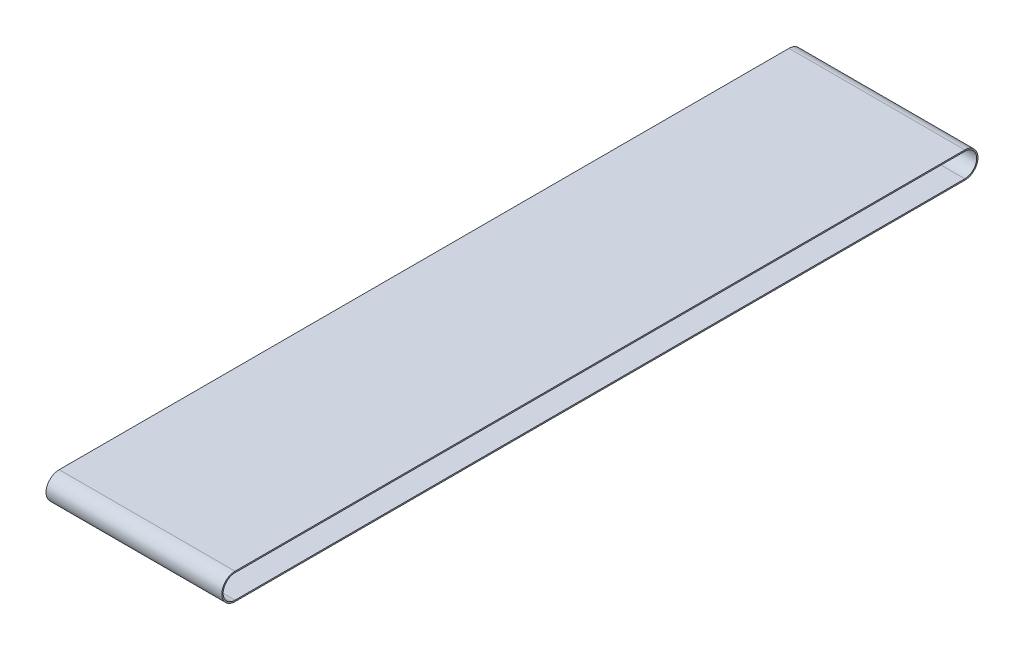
ISO-10303-21;
HEADER;
FILE_DESCRIPTION(('STEP AP214'),'2;1');
FILE_NAME('part.step','',(''),(''),'','','');
FILE_SCHEMA(('AUTOMOTIVE_DESIGN { 1 0 10303 214 1 1 1 1 }'));
ENDSEC;
DATA;
#1=APPLICATION_CONTEXT('core data for automotive mechanical design processes');
#2=APPLICATION_PROTOCOL_DEFINITION('international standard','automotive_design',2000,#1);
#3=PRODUCT_CONTEXT('',#1,'mechanical');
#4=PRODUCT('Part','Part','',(#3));
#5=PRODUCT_RELATED_PRODUCT_CATEGORY('part','',(#4));
#6=PRODUCT_DEFINITION_FORMATION('','',#4);
#7=PRODUCT_DEFINITION_CONTEXT('part definition',#1,'design');
#8=PRODUCT_DEFINITION('design','',#6,#7);
#9=PRODUCT_DEFINITION_SHAPE('','',#8);
#10=(LENGTH_UNIT() NAMED_UNIT(*) SI_UNIT(.MILLI.,.METRE.));
#11=(NAMED_UNIT(*) PLANE_ANGLE_UNIT() SI_UNIT($,.RADIAN.));
#12=(NAMED_UNIT(*) SI_UNIT($,.STERADIAN.) SOLID_ANGLE_UNIT());
#13=UNCERTAINTY_MEASURE_WITH_UNIT(LENGTH_MEASURE(1.E-05),#10,'distance_accuracy_value','');
#14=(GEOMETRIC_REPRESENTATION_CONTEXT(3) GLOBAL_UNCERTAINTY_ASSIGNED_CONTEXT((#13)) GLOBAL_UNIT_ASSIGNED_CONTEXT((#10,
#11,#12)) REPRESENTATION_CONTEXT('',''));
#15=CARTESIAN_POINT('',(0.,0.,0.));
#16=DIRECTION('',(0.,0.,1.));
#17=DIRECTION('',(1.,0.,0.));
#18=AXIS2_PLACEMENT_3D('',#15,#16,#17);
#19=CARTESIAN_POINT('',(400.,30.,0.));
#20=DIRECTION('',(0.,-1.,0.));
#21=DIRECTION('',(0.,0.,-1.));
#22=AXIS2_PLACEMENT_3D('',#19,#20,#21);
#23=PLANE('',#22);
#24=DIRECTION('',(-1.,0.,0.));
#25=VECTOR('',#24,1.);
#26=CARTESIAN_POINT('',(400.,30.,0.));
#27=LINE('',#26,#25);
#28=CARTESIAN_POINT('',(400.,30.,0.));
#29=VERTEX_POINT('',#28);
#30=CARTESIAN_POINT('',(0.,30.,0.));
#31=VERTEX_POINT('',#30);
#32=EDGE_CURVE('E116',#29,#31,#27,.T.);
#33=ORIENTED_EDGE('',*,*,#32,.F.);
#34=DIRECTION('',(0.,0.,-1.));
#35=VECTOR('',#34,1.);
#36=CARTESIAN_POINT('',(400.,30.,0.));
#37=LINE('',#36,#35);
#38=CARTESIAN_POINT('',(400.,30.,-1660.));
#39=VERTEX_POINT('',#38);
#40=EDGE_CURVE('E74',#39,#29,#37,.F.);
#41=ORIENTED_EDGE('',*,*,#40,.F.);
#42=DIRECTION('',(-1.,0.,0.));
#43=VECTOR('',#42,1.);
#44=CARTESIAN_POINT('',(400.,30.,-1660.));
#45=LINE('',#44,#43);
#46=CARTESIAN_POINT('',(0.,30.,-1660.));
#47=VERTEX_POINT('',#46);
#48=EDGE_CURVE('E118',#47,#39,#45,.F.);
#49=ORIENTED_EDGE('',*,*,#48,.F.);
#50=DIRECTION('',(0.,0.,-1.));
#51=VECTOR('',#50,1.);
#52=CARTESIAN_POINT('',(0.,30.,0.));
#53=LINE('',#52,#51);
#54=EDGE_CURVE('E126',#47,#31,#53,.F.);
#55=ORIENTED_EDGE('',*,*,#54,.T.);
#56=EDGE_LOOP('',(#33,#41,#49,#55));
#57=FACE_BOUND('',#56,.T.);
#58=ADVANCED_FACE('F17',(#57),#23,.F.);
#59=CARTESIAN_POINT('',(400.,27.,0.));
#60=DIRECTION('',(0.,-1.,0.));
#61=DIRECTION('',(0.,0.,-1.));
#62=AXIS2_PLACEMENT_3D('',#59,#60,#61);
#63=PLANE('',#62);
#64=DIRECTION('',(0.,0.,-1.));
#65=VECTOR('',#64,1.);
#66=CARTESIAN_POINT('',(400.,27.,0.));
#67=LINE('',#66,#65);
#68=CARTESIAN_POINT('',(400.,27.,0.));
#69=VERTEX_POINT('',#68);
#70=CARTESIAN_POINT('',(400.,27.,-1660.));
#71=VERTEX_POINT('',#70);
#72=EDGE_CURVE('E97',#69,#71,#67,.T.);
#73=ORIENTED_EDGE('',*,*,#72,.F.);
#74=DIRECTION('',(-1.,0.,0.));
#75=VECTOR('',#74,1.);
#76=CARTESIAN_POINT('',(400.,27.,0.));
#77=LINE('',#76,#75);
#78=CARTESIAN_POINT('',(0.,27.,0.));
#79=VERTEX_POINT('',#78);
#80=EDGE_CURVE('E79',#69,#79,#77,.T.);
#81=ORIENTED_EDGE('',*,*,#80,.T.);
#82=DIRECTION('',(0.,0.,-1.));
#83=VECTOR('',#82,1.);
#84=CARTESIAN_POINT('',(0.,27.,0.));
#85=LINE('',#84,#83);
#86=CARTESIAN_POINT('',(0.,27.,-1660.));
#87=VERTEX_POINT('',#86);
#88=EDGE_CURVE('E124',#79,#87,#85,.T.);
#89=ORIENTED_EDGE('',*,*,#88,.T.);
#90=DIRECTION('',(-1.,0.,0.));
#91=VECTOR('',#90,1.);
#92=CARTESIAN_POINT('',(400.,26.9999999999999,-1660.));
#93=LINE('',#92,#91);
#94=EDGE_CURVE('E113',#87,#71,#93,.F.);
#95=ORIENTED_EDGE('',*,*,#94,.T.);
#96=EDGE_LOOP('',(#73,#81,#89,#95));
#97=FACE_BOUND('',#96,.T.);
#98=ADVANCED_FACE('F137',(#97),#63,.T.);
#99=CARTESIAN_POINT('',(400.,0.,-1660.));
#100=DIRECTION('',(-1.,0.,0.));
#101=DIRECTION('',(0.,0.,1.));
#102=AXIS2_PLACEMENT_3D('',#99,#100,#101);
#103=CYLINDRICAL_SURFACE('',#102,26.9999999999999);
#104=DIRECTION('',(1.,0.,0.));
#105=VECTOR('',#104,1.);
#106=CARTESIAN_POINT('',(400.,-27.,-1660.));
#107=LINE('',#106,#105);
#108=CARTESIAN_POINT('',(400.,-27.,-1660.));
#109=VERTEX_POINT('',#108);
#110=CARTESIAN_POINT('',(0.,-27.,-1660.));
#111=VERTEX_POINT('',#110);
#112=EDGE_CURVE('E110',#109,#111,#107,.F.);
#113=ORIENTED_EDGE('',*,*,#112,.F.);
#114=CARTESIAN_POINT('',(400.,0.,-1660.));
#115=DIRECTION('',(-1.,0.,0.));
#116=DIRECTION('',(0.,0.,1.));
#117=AXIS2_PLACEMENT_3D('',#114,#115,#116);
#118=CIRCLE('',#117,26.9999999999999);
#119=EDGE_CURVE('E99',#71,#109,#118,.T.);
#120=ORIENTED_EDGE('',*,*,#119,.F.);
#121=ORIENTED_EDGE('',*,*,#94,.F.);
#122=CARTESIAN_POINT('',(0.,0.,-1660.));
#123=DIRECTION('',(-1.,0.,0.));
#124=DIRECTION('',(0.,0.,1.));
#125=AXIS2_PLACEMENT_3D('',#122,#123,#124);
#126=CIRCLE('',#125,26.9999999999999);
#127=EDGE_CURVE('E121',#87,#111,#126,.T.);
#128=ORIENTED_EDGE('',*,*,#127,.T.);
#129=EDGE_LOOP('',(#113,#120,#121,#128));
#130=FACE_BOUND('',#129,.T.);
#131=ADVANCED_FACE('F146',(#130),#103,.F.);
#132=CARTESIAN_POINT('',(400.,-27.,0.));
#133=DIRECTION('',(0.,1.,0.));
#134=DIRECTION('',(0.,0.,1.));
#135=AXIS2_PLACEMENT_3D('',#132,#133,#134);
#136=PLANE('',#135);
#137=DIRECTION('',(0.,0.,-1.));
#138=VECTOR('',#137,1.);
#139=CARTESIAN_POINT('',(400.,-27.,0.));
#140=LINE('',#139,#138);
#141=CARTESIAN_POINT('',(400.,-27.,0.));
#142=VERTEX_POINT('',#141);
#143=EDGE_CURVE('E101',#109,#142,#140,.F.);
#144=ORIENTED_EDGE('',*,*,#143,.F.);
#145=ORIENTED_EDGE('',*,*,#112,.T.);
#146=DIRECTION('',(0.,0.,-1.));
#147=VECTOR('',#146,1.);
#148=CARTESIAN_POINT('',(0.,-27.,0.));
#149=LINE('',#148,#147);
#150=CARTESIAN_POINT('',(0.,-27.,0.));
#151=VERTEX_POINT('',#150);
#152=EDGE_CURVE('E93',#111,#151,#149,.F.);
#153=ORIENTED_EDGE('',*,*,#152,.T.);
#154=DIRECTION('',(-1.,0.,0.));
#155=VECTOR('',#154,1.);
#156=CARTESIAN_POINT('',(400.,-27.,0.));
#157=LINE('',#156,#155);
#158=EDGE_CURVE('E107',#151,#142,#157,.F.);
#159=ORIENTED_EDGE('',*,*,#158,.T.);
#160=EDGE_LOOP('',(#144,#145,#153,#159));
#161=FACE_BOUND('',#160,.T.);
#162=ADVANCED_FACE('F148',(#161),#136,.T.);
#163=CARTESIAN_POINT('',(400.,0.,0.));
#164=DIRECTION('',(-1.,0.,0.));
#165=DIRECTION('',(0.,0.,1.));
#166=AXIS2_PLACEMENT_3D('',#163,#164,#165);
#167=CYLINDRICAL_SURFACE('',#166,27.);
#168=CARTESIAN_POINT('',(400.,0.,0.));
#169=DIRECTION('',(-1.,0.,0.));
#170=DIRECTION('',(0.,0.,1.));
#171=AXIS2_PLACEMENT_3D('',#168,#169,#170);
#172=CIRCLE('',#171,27.);
#173=EDGE_CURVE('E100',#142,#69,#172,.T.);
#174=ORIENTED_EDGE('',*,*,#173,.F.);
#175=ORIENTED_EDGE('',*,*,#158,.F.);
#176=CARTESIAN_POINT('',(0.,0.,0.));
#177=DIRECTION('',(-1.,0.,0.));
#178=DIRECTION('',(0.,0.,1.));
#179=AXIS2_PLACEMENT_3D('',#176,#177,#178);
#180=CIRCLE('',#179,27.);
#181=EDGE_CURVE('E90',#151,#79,#180,.T.);
#182=ORIENTED_EDGE('',*,*,#181,.T.);
#183=ORIENTED_EDGE('',*,*,#80,.F.);
#184=EDGE_LOOP('',(#174,#175,#182,#183));
#185=FACE_BOUND('',#184,.T.);
#186=ADVANCED_FACE('F152',(#185),#167,.F.);
#187=CARTESIAN_POINT('',(400.,0.,0.));
#188=DIRECTION('',(-1.,0.,0.));
#189=DIRECTION('',(0.,0.,1.));
#190=AXIS2_PLACEMENT_3D('',#187,#188,#189);
#191=CYLINDRICAL_SURFACE('',#190,30.);
#192=CARTESIAN_POINT('',(0.,0.,0.));
#193=DIRECTION('',(-1.,0.,0.));
#194=DIRECTION('',(0.,0.,1.));
#195=AXIS2_PLACEMENT_3D('',#192,#193,#194);
#196=CIRCLE('',#195,30.);
#197=CARTESIAN_POINT('',(0.,-30.,0.));
#198=VERTEX_POINT('',#197);
#199=EDGE_CURVE('E89',#31,#198,#196,.F.);
#200=ORIENTED_EDGE('',*,*,#199,.T.);
#201=DIRECTION('',(1.,0.,0.));
#202=VECTOR('',#201,1.);
#203=CARTESIAN_POINT('',(400.,-30.,0.));
#204=LINE('',#203,#202);
#205=CARTESIAN_POINT('',(400.,-30.,0.));
#206=VERTEX_POINT('',#205);
#207=EDGE_CURVE('E84',#198,#206,#204,.T.);
#208=ORIENTED_EDGE('',*,*,#207,.T.);
#209=CARTESIAN_POINT('',(400.,0.,0.));
#210=DIRECTION('',(-1.,0.,0.));
#211=DIRECTION('',(0.,0.,1.));
#212=AXIS2_PLACEMENT_3D('',#209,#210,#211);
#213=CIRCLE('',#212,30.);
#214=EDGE_CURVE('E20',#29,#206,#213,.F.);
#215=ORIENTED_EDGE('',*,*,#214,.F.);
#216=ORIENTED_EDGE('',*,*,#32,.T.);
#217=EDGE_LOOP('',(#200,#208,#215,#216));
#218=FACE_BOUND('',#217,.T.);
#219=ADVANCED_FACE('F87',(#218),#191,.T.);
#220=CARTESIAN_POINT('',(400.,0.,0.));
#221=DIRECTION('',(1.,0.,0.));
#222=DIRECTION('',(0.,0.,-1.));
#223=AXIS2_PLACEMENT_3D('',#220,#221,#222);
#224=PLANE('',#223);
#225=ORIENTED_EDGE('',*,*,#72,.T.);
#226=ORIENTED_EDGE('',*,*,#119,.T.);
#227=ORIENTED_EDGE('',*,*,#143,.T.);
#228=ORIENTED_EDGE('',*,*,#173,.T.);
#229=EDGE_LOOP('',(#225,#226,#227,#228));
#230=FACE_BOUND('',#229,.T.);
#231=CARTESIAN_POINT('',(400.,0.,-1660.));
#232=DIRECTION('',(-1.,0.,0.));
#233=DIRECTION('',(0.,0.,1.));
#234=AXIS2_PLACEMENT_3D('',#231,#232,#233);
#235=CIRCLE('',#234,30.);
#236=CARTESIAN_POINT('',(400.,-30.,-1660.));
#237=VERTEX_POINT('',#236);
#238=EDGE_CURVE('E119',#39,#237,#235,.T.);
#239=ORIENTED_EDGE('',*,*,#238,.F.);
#240=ORIENTED_EDGE('',*,*,#40,.T.);
#241=ORIENTED_EDGE('',*,*,#214,.T.);
#242=DIRECTION('',(0.,0.,1.));
#243=VECTOR('',#242,1.);
#244=CARTESIAN_POINT('',(400.,-30.,0.));
#245=LINE('',#244,#243);
#246=EDGE_CURVE('E72',#206,#237,#245,.F.);
#247=ORIENTED_EDGE('',*,*,#246,.T.);
#248=EDGE_LOOP('',(#239,#240,#241,#247));
#249=FACE_BOUND('',#248,.T.);
#250=ADVANCED_FACE('F71',(#230,#249),#224,.T.);
#251=CARTESIAN_POINT('',(400.,0.,-1660.));
#252=DIRECTION('',(-1.,0.,0.));
#253=DIRECTION('',(0.,0.,1.));
#254=AXIS2_PLACEMENT_3D('',#251,#252,#253);
#255=CYLINDRICAL_SURFACE('',#254,30.);
#256=ORIENTED_EDGE('',*,*,#238,.T.);
#257=DIRECTION('',(1.,0.,0.));
#258=VECTOR('',#257,1.);
#259=CARTESIAN_POINT('',(400.,-30.,-1660.));
#260=LINE('',#259,#258);
#261=CARTESIAN_POINT('',(0.,-30.,-1660.));
#262=VERTEX_POINT('',#261);
#263=EDGE_CURVE('E26',#237,#262,#260,.F.);
#264=ORIENTED_EDGE('',*,*,#263,.T.);
#265=CARTESIAN_POINT('',(0.,0.,-1660.));
#266=DIRECTION('',(-1.,0.,0.));
#267=DIRECTION('',(0.,0.,1.));
#268=AXIS2_PLACEMENT_3D('',#265,#266,#267);
#269=CIRCLE('',#268,30.);
#270=EDGE_CURVE('E34',#262,#47,#269,.F.);
#271=ORIENTED_EDGE('',*,*,#270,.T.);
#272=ORIENTED_EDGE('',*,*,#48,.T.);
#273=EDGE_LOOP('',(#256,#264,#271,#272));
#274=FACE_BOUND('',#273,.T.);
#275=ADVANCED_FACE('F165',(#274),#255,.T.);
#276=CARTESIAN_POINT('',(0.,0.,0.));
#277=DIRECTION('',(1.,0.,0.));
#278=DIRECTION('',(0.,0.,-1.));
#279=AXIS2_PLACEMENT_3D('',#276,#277,#278);
#280=PLANE('',#279);
#281=ORIENTED_EDGE('',*,*,#181,.F.);
#282=ORIENTED_EDGE('',*,*,#152,.F.);
#283=ORIENTED_EDGE('',*,*,#127,.F.);
#284=ORIENTED_EDGE('',*,*,#88,.F.);
#285=EDGE_LOOP('',(#281,#282,#283,#284));
#286=FACE_BOUND('',#285,.T.);
#287=ORIENTED_EDGE('',*,*,#54,.F.);
#288=ORIENTED_EDGE('',*,*,#270,.F.);
#289=DIRECTION('',(0.,0.,1.));
#290=VECTOR('',#289,1.);
#291=CARTESIAN_POINT('',(0.,-30.,0.));
#292=LINE('',#291,#290);
#293=EDGE_CURVE('E11',#262,#198,#292,.T.);
#294=ORIENTED_EDGE('',*,*,#293,.T.);
#295=ORIENTED_EDGE('',*,*,#199,.F.);
#296=EDGE_LOOP('',(#287,#288,#294,#295));
#297=FACE_BOUND('',#296,.T.);
#298=ADVANCED_FACE('F160',(#286,#297),#280,.F.);
#299=CARTESIAN_POINT('',(400.,-30.,0.));
#300=DIRECTION('',(0.,1.,0.));
#301=DIRECTION('',(0.,0.,1.));
#302=AXIS2_PLACEMENT_3D('',#299,#300,#301);
#303=PLANE('',#302);
#304=ORIENTED_EDGE('',*,*,#263,.F.);
#305=ORIENTED_EDGE('',*,*,#246,.F.);
#306=ORIENTED_EDGE('',*,*,#207,.F.);
#307=ORIENTED_EDGE('',*,*,#293,.F.);
#308=EDGE_LOOP('',(#304,#305,#306,#307));
#309=FACE_BOUND('',#308,.T.);
#310=ADVANCED_FACE('F83',(#309),#303,.F.);
#311=CLOSED_SHELL('',(#58,#98,#131,#162,#186,#219,#250,#275,#298,#310));
#312=MANIFOLD_SOLID_BREP('B1',#311);
#313=ADVANCED_BREP_SHAPE_REPRESENTATION('',(#18,#312),#14);
#314=SHAPE_DEFINITION_REPRESENTATION(#9,#313);
ENDSEC;
END-ISO-10303-21;
